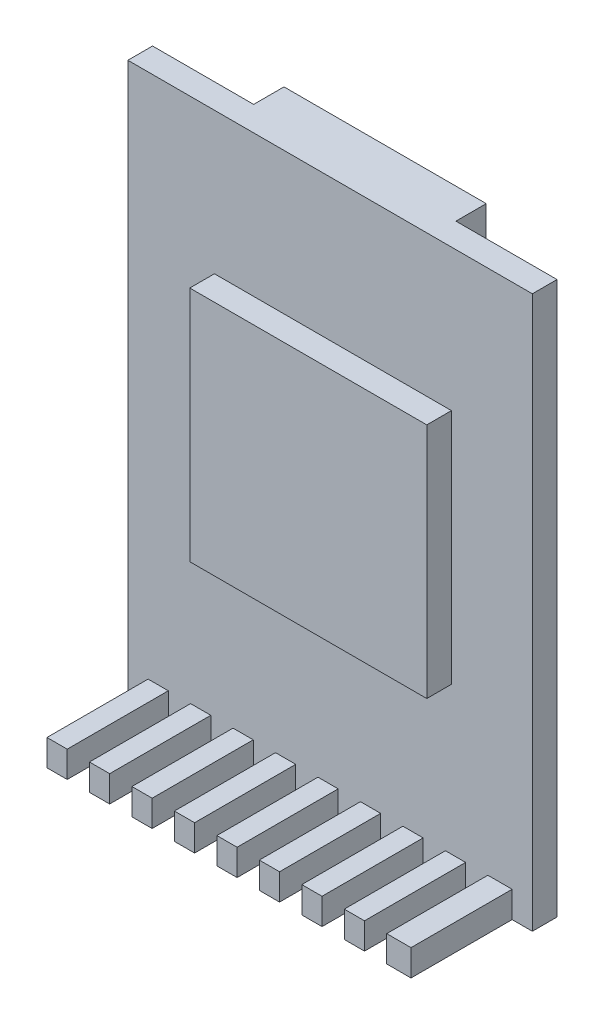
ISO-10303-21;
HEADER;
FILE_DESCRIPTION(('STEP AP214'),'2;1');
FILE_NAME('part.step','',(''),(''),'','','');
FILE_SCHEMA(('AUTOMOTIVE_DESIGN { 1 0 10303 214 1 1 1 1 }'));
ENDSEC;
DATA;
#1=APPLICATION_CONTEXT('core data for automotive mechanical design processes');
#2=APPLICATION_PROTOCOL_DEFINITION('international standard','automotive_design',2000,#1);
#3=PRODUCT_CONTEXT('',#1,'mechanical');
#4=PRODUCT('Part','Part','',(#3));
#5=PRODUCT_RELATED_PRODUCT_CATEGORY('part','',(#4));
#6=PRODUCT_DEFINITION_FORMATION('','',#4);
#7=PRODUCT_DEFINITION_CONTEXT('part definition',#1,'design');
#8=PRODUCT_DEFINITION('design','',#6,#7);
#9=PRODUCT_DEFINITION_SHAPE('','',#8);
#10=(LENGTH_UNIT() NAMED_UNIT(*) SI_UNIT(.MILLI.,.METRE.));
#11=(NAMED_UNIT(*) PLANE_ANGLE_UNIT() SI_UNIT($,.RADIAN.));
#12=(NAMED_UNIT(*) SI_UNIT($,.STERADIAN.) SOLID_ANGLE_UNIT());
#13=UNCERTAINTY_MEASURE_WITH_UNIT(LENGTH_MEASURE(1.E-05),#10,'distance_accuracy_value','');
#14=(GEOMETRIC_REPRESENTATION_CONTEXT(3) GLOBAL_UNCERTAINTY_ASSIGNED_CONTEXT((#13)) GLOBAL_UNIT_ASSIGNED_CONTEXT((#10,
#11,#12)) REPRESENTATION_CONTEXT('',''));
#15=CARTESIAN_POINT('',(0.,0.,0.));
#16=DIRECTION('',(0.,0.,1.));
#17=DIRECTION('',(1.,0.,0.));
#18=AXIS2_PLACEMENT_3D('',#15,#16,#17);
#19=CARTESIAN_POINT('',(1.27,1.651,7.8994));
#20=DIRECTION('',(0.,-1.,0.));
#21=DIRECTION('',(0.,0.,-1.));
#22=AXIS2_PLACEMENT_3D('',#19,#20,#21);
#23=PLANE('',#22);
#24=DIRECTION('',(-1.,0.,0.));
#25=VECTOR('',#24,1.);
#26=CARTESIAN_POINT('',(1.27,1.651,7.8994));
#27=LINE('',#26,#25);
#28=CARTESIAN_POINT('',(2.54,1.651,7.8994));
#29=VERTEX_POINT('',#28);
#30=CARTESIAN_POINT('',(1.27,1.651,7.8994));
#31=VERTEX_POINT('',#30);
#32=EDGE_CURVE('E595',#29,#31,#27,.T.);
#33=ORIENTED_EDGE('',*,*,#32,.F.);
#34=DIRECTION('',(0.,0.,1.));
#35=VECTOR('',#34,1.);
#36=CARTESIAN_POINT('',(2.54,1.651,7.8994));
#37=LINE('',#36,#35);
#38=CARTESIAN_POINT('',(2.54,1.651,1.5494));
#39=VERTEX_POINT('',#38);
#40=EDGE_CURVE('E384',#39,#29,#37,.T.);
#41=ORIENTED_EDGE('',*,*,#40,.F.);
#42=DIRECTION('',(-1.,0.,0.));
#43=VECTOR('',#42,1.);
#44=CARTESIAN_POINT('',(1.27,1.651,1.5494));
#45=LINE('',#44,#43);
#46=CARTESIAN_POINT('',(1.27,1.651,1.5494));
#47=VERTEX_POINT('',#46);
#48=EDGE_CURVE('E609',#39,#47,#45,.T.);
#49=ORIENTED_EDGE('',*,*,#48,.T.);
#50=DIRECTION('',(0.,0.,-1.));
#51=VECTOR('',#50,1.);
#52=CARTESIAN_POINT('',(1.27,1.651,7.8994));
#53=LINE('',#52,#51);
#54=EDGE_CURVE('E600',#31,#47,#53,.T.);
#55=ORIENTED_EDGE('',*,*,#54,.F.);
#56=EDGE_LOOP('',(#33,#41,#49,#55));
#57=FACE_BOUND('',#56,.T.);
#58=ADVANCED_FACE('F45',(#57),#23,.F.);
#59=CARTESIAN_POINT('',(5.207,1.651,1.5494));
#60=VERTEX_POINT('',#59);
#61=CARTESIAN_POINT('',(3.937,1.651,1.5494));
#62=VERTEX_POINT('',#61);
#63=EDGE_CURVE('E889',#60,#62,#45,.T.);
#64=ORIENTED_EDGE('',*,*,#63,.T.);
#65=DIRECTION('',(0.,0.,-1.));
#66=VECTOR('',#65,1.);
#67=CARTESIAN_POINT('',(3.937,1.651,7.8994));
#68=LINE('',#67,#66);
#69=CARTESIAN_POINT('',(3.937,1.651,7.8994));
#70=VERTEX_POINT('',#69);
#71=EDGE_CURVE('E387',#70,#62,#68,.T.);
#72=ORIENTED_EDGE('',*,*,#71,.F.);
#73=CARTESIAN_POINT('',(5.207,1.651,7.8994));
#74=VERTEX_POINT('',#73);
#75=EDGE_CURVE('E782',#74,#70,#27,.T.);
#76=ORIENTED_EDGE('',*,*,#75,.F.);
#77=DIRECTION('',(0.,0.,1.));
#78=VECTOR('',#77,1.);
#79=CARTESIAN_POINT('',(5.207,1.651,7.8994));
#80=LINE('',#79,#78);
#81=EDGE_CURVE('E388',#60,#74,#80,.T.);
#82=ORIENTED_EDGE('',*,*,#81,.F.);
#83=EDGE_LOOP('',(#64,#72,#76,#82));
#84=FACE_BOUND('',#83,.T.);
#85=ADVANCED_FACE('F953',(#84),#23,.F.);
#86=CARTESIAN_POINT('',(7.874,1.651,1.5494));
#87=VERTEX_POINT('',#86);
#88=CARTESIAN_POINT('',(6.604,1.651,1.5494));
#89=VERTEX_POINT('',#88);
#90=EDGE_CURVE('E892',#87,#89,#45,.T.);
#91=ORIENTED_EDGE('',*,*,#90,.T.);
#92=DIRECTION('',(0.,0.,-1.));
#93=VECTOR('',#92,1.);
#94=CARTESIAN_POINT('',(6.604,1.651,7.8994));
#95=LINE('',#94,#93);
#96=CARTESIAN_POINT('',(6.604,1.651,7.8994));
#97=VERTEX_POINT('',#96);
#98=EDGE_CURVE('E402',#97,#89,#95,.T.);
#99=ORIENTED_EDGE('',*,*,#98,.F.);
#100=CARTESIAN_POINT('',(7.874,1.651,7.8994));
#101=VERTEX_POINT('',#100);
#102=EDGE_CURVE('E866',#101,#97,#27,.T.);
#103=ORIENTED_EDGE('',*,*,#102,.F.);
#104=DIRECTION('',(0.,0.,1.));
#105=VECTOR('',#104,1.);
#106=CARTESIAN_POINT('',(7.874,1.651,7.8994));
#107=LINE('',#106,#105);
#108=EDGE_CURVE('E406',#87,#101,#107,.T.);
#109=ORIENTED_EDGE('',*,*,#108,.F.);
#110=EDGE_LOOP('',(#91,#99,#103,#109));
#111=FACE_BOUND('',#110,.T.);
#112=ADVANCED_FACE('F959',(#111),#23,.F.);
#113=CARTESIAN_POINT('',(10.541,1.651,1.5494));
#114=VERTEX_POINT('',#113);
#115=CARTESIAN_POINT('',(9.271,1.651,1.5494));
#116=VERTEX_POINT('',#115);
#117=EDGE_CURVE('E898',#114,#116,#45,.T.);
#118=ORIENTED_EDGE('',*,*,#117,.T.);
#119=DIRECTION('',(0.,0.,-1.));
#120=VECTOR('',#119,1.);
#121=CARTESIAN_POINT('',(9.271,1.651,7.8994));
#122=LINE('',#121,#120);
#123=CARTESIAN_POINT('',(9.271,1.651,7.8994));
#124=VERTEX_POINT('',#123);
#125=EDGE_CURVE('E415',#124,#116,#122,.T.);
#126=ORIENTED_EDGE('',*,*,#125,.F.);
#127=CARTESIAN_POINT('',(10.541,1.651,7.8994));
#128=VERTEX_POINT('',#127);
#129=EDGE_CURVE('E862',#128,#124,#27,.T.);
#130=ORIENTED_EDGE('',*,*,#129,.F.);
#131=DIRECTION('',(0.,0.,1.));
#132=VECTOR('',#131,1.);
#133=CARTESIAN_POINT('',(10.541,1.651,7.8994));
#134=LINE('',#133,#132);
#135=EDGE_CURVE('E419',#114,#128,#134,.T.);
#136=ORIENTED_EDGE('',*,*,#135,.F.);
#137=EDGE_LOOP('',(#118,#126,#130,#136));
#138=FACE_BOUND('',#137,.T.);
#139=ADVANCED_FACE('F981',(#138),#23,.F.);
#140=CARTESIAN_POINT('',(13.208,1.651,1.5494));
#141=VERTEX_POINT('',#140);
#142=CARTESIAN_POINT('',(11.938,1.651,1.5494));
#143=VERTEX_POINT('',#142);
#144=EDGE_CURVE('E905',#141,#143,#45,.T.);
#145=ORIENTED_EDGE('',*,*,#144,.T.);
#146=DIRECTION('',(0.,0.,-1.));
#147=VECTOR('',#146,1.);
#148=CARTESIAN_POINT('',(11.938,1.651,7.8994));
#149=LINE('',#148,#147);
#150=CARTESIAN_POINT('',(11.938,1.651,7.8994));
#151=VERTEX_POINT('',#150);
#152=EDGE_CURVE('E428',#151,#143,#149,.T.);
#153=ORIENTED_EDGE('',*,*,#152,.F.);
#154=CARTESIAN_POINT('',(13.208,1.651,7.8994));
#155=VERTEX_POINT('',#154);
#156=EDGE_CURVE('E858',#155,#151,#27,.T.);
#157=ORIENTED_EDGE('',*,*,#156,.F.);
#158=DIRECTION('',(0.,0.,1.));
#159=VECTOR('',#158,1.);
#160=CARTESIAN_POINT('',(13.208,1.651,7.8994));
#161=LINE('',#160,#159);
#162=EDGE_CURVE('E432',#141,#155,#161,.T.);
#163=ORIENTED_EDGE('',*,*,#162,.F.);
#164=EDGE_LOOP('',(#145,#153,#157,#163));
#165=FACE_BOUND('',#164,.T.);
#166=ADVANCED_FACE('F977',(#165),#23,.F.);
#167=CARTESIAN_POINT('',(15.875,1.651,1.5494));
#168=VERTEX_POINT('',#167);
#169=CARTESIAN_POINT('',(14.605,1.651,1.5494));
#170=VERTEX_POINT('',#169);
#171=EDGE_CURVE('E912',#168,#170,#45,.T.);
#172=ORIENTED_EDGE('',*,*,#171,.T.);
#173=DIRECTION('',(0.,0.,-1.));
#174=VECTOR('',#173,1.);
#175=CARTESIAN_POINT('',(14.605,1.651,7.8994));
#176=LINE('',#175,#174);
#177=CARTESIAN_POINT('',(14.605,1.651,7.8994));
#178=VERTEX_POINT('',#177);
#179=EDGE_CURVE('E441',#178,#170,#176,.T.);
#180=ORIENTED_EDGE('',*,*,#179,.F.);
#181=CARTESIAN_POINT('',(15.875,1.651,7.8994));
#182=VERTEX_POINT('',#181);
#183=EDGE_CURVE('E854',#182,#178,#27,.T.);
#184=ORIENTED_EDGE('',*,*,#183,.F.);
#185=DIRECTION('',(0.,0.,1.));
#186=VECTOR('',#185,1.);
#187=CARTESIAN_POINT('',(15.875,1.651,7.8994));
#188=LINE('',#187,#186);
#189=EDGE_CURVE('E445',#168,#182,#188,.T.);
#190=ORIENTED_EDGE('',*,*,#189,.F.);
#191=EDGE_LOOP('',(#172,#180,#184,#190));
#192=FACE_BOUND('',#191,.T.);
#193=ADVANCED_FACE('F973',(#192),#23,.F.);
#194=CARTESIAN_POINT('',(18.542,1.651,1.5494));
#195=VERTEX_POINT('',#194);
#196=CARTESIAN_POINT('',(17.272,1.651,1.5494));
#197=VERTEX_POINT('',#196);
#198=EDGE_CURVE('E919',#195,#197,#45,.T.);
#199=ORIENTED_EDGE('',*,*,#198,.T.);
#200=DIRECTION('',(0.,0.,-1.));
#201=VECTOR('',#200,1.);
#202=CARTESIAN_POINT('',(17.272,1.651,7.8994));
#203=LINE('',#202,#201);
#204=CARTESIAN_POINT('',(17.272,1.651,7.8994));
#205=VERTEX_POINT('',#204);
#206=EDGE_CURVE('E454',#205,#197,#203,.T.);
#207=ORIENTED_EDGE('',*,*,#206,.F.);
#208=CARTESIAN_POINT('',(18.542,1.651,7.8994));
#209=VERTEX_POINT('',#208);
#210=EDGE_CURVE('E851',#209,#205,#27,.T.);
#211=ORIENTED_EDGE('',*,*,#210,.F.);
#212=DIRECTION('',(0.,0.,1.));
#213=VECTOR('',#212,1.);
#214=CARTESIAN_POINT('',(18.542,1.651,7.8994));
#215=LINE('',#214,#213);
#216=EDGE_CURVE('E458',#195,#209,#215,.T.);
#217=ORIENTED_EDGE('',*,*,#216,.F.);
#218=EDGE_LOOP('',(#199,#207,#211,#217));
#219=FACE_BOUND('',#218,.T.);
#220=ADVANCED_FACE('F931',(#219),#23,.F.);
#221=CARTESIAN_POINT('',(21.209,1.651,1.5494));
#222=VERTEX_POINT('',#221);
#223=CARTESIAN_POINT('',(19.939,1.651,1.5494));
#224=VERTEX_POINT('',#223);
#225=EDGE_CURVE('E613',#222,#224,#45,.T.);
#226=ORIENTED_EDGE('',*,*,#225,.T.);
#227=DIRECTION('',(0.,0.,-1.));
#228=VECTOR('',#227,1.);
#229=CARTESIAN_POINT('',(19.939,1.651,7.8994));
#230=LINE('',#229,#228);
#231=CARTESIAN_POINT('',(19.939,1.651,7.8994));
#232=VERTEX_POINT('',#231);
#233=EDGE_CURVE('E467',#232,#224,#230,.T.);
#234=ORIENTED_EDGE('',*,*,#233,.F.);
#235=CARTESIAN_POINT('',(21.209,1.651,7.8994));
#236=VERTEX_POINT('',#235);
#237=EDGE_CURVE('E601',#236,#232,#27,.T.);
#238=ORIENTED_EDGE('',*,*,#237,.F.);
#239=DIRECTION('',(0.,0.,1.));
#240=VECTOR('',#239,1.);
#241=CARTESIAN_POINT('',(21.209,1.651,7.8994));
#242=LINE('',#241,#240);
#243=EDGE_CURVE('E471',#222,#236,#242,.T.);
#244=ORIENTED_EDGE('',*,*,#243,.F.);
#245=EDGE_LOOP('',(#226,#234,#238,#244));
#246=FACE_BOUND('',#245,.T.);
#247=ADVANCED_FACE('F847',(#246),#23,.F.);
#248=CARTESIAN_POINT('',(0.,0.,7.8994));
#249=DIRECTION('',(0.,0.,-1.));
#250=DIRECTION('',(-1.,0.,0.));
#251=AXIS2_PLACEMENT_3D('',#248,#249,#250);
#252=PLANE('',#251);
#253=DIRECTION('',(1.,0.,0.));
#254=VECTOR('',#253,1.);
#255=CARTESIAN_POINT('',(1.27,0.,7.8994));
#256=LINE('',#255,#254);
#257=CARTESIAN_POINT('',(1.27,0.,7.8994));
#258=VERTEX_POINT('',#257);
#259=CARTESIAN_POINT('',(2.54,0.,7.8994));
#260=VERTEX_POINT('',#259);
#261=EDGE_CURVE('E587',#258,#260,#256,.T.);
#262=ORIENTED_EDGE('',*,*,#261,.T.);
#263=DIRECTION('',(0.,1.,0.));
#264=VECTOR('',#263,1.);
#265=CARTESIAN_POINT('',(2.54,0.,7.8994));
#266=LINE('',#265,#264);
#267=EDGE_CURVE('E11',#260,#29,#266,.T.);
#268=ORIENTED_EDGE('',*,*,#267,.T.);
#269=ORIENTED_EDGE('',*,*,#32,.T.);
#270=DIRECTION('',(0.,-1.,0.));
#271=VECTOR('',#270,1.);
#272=CARTESIAN_POINT('',(1.27,0.,7.8994));
#273=LINE('',#272,#271);
#274=EDGE_CURVE('E581',#31,#258,#273,.T.);
#275=ORIENTED_EDGE('',*,*,#274,.T.);
#276=EDGE_LOOP('',(#262,#268,#269,#275));
#277=FACE_BOUND('',#276,.T.);
#278=ADVANCED_FACE('F876',(#277),#252,.F.);
#279=ORIENTED_EDGE('',*,*,#75,.T.);
#280=DIRECTION('',(0.,-1.,0.));
#281=VECTOR('',#280,1.);
#282=CARTESIAN_POINT('',(3.937,0.,7.8994));
#283=LINE('',#282,#281);
#284=CARTESIAN_POINT('',(3.937,0.,7.8994));
#285=VERTEX_POINT('',#284);
#286=EDGE_CURVE('E54',#70,#285,#283,.T.);
#287=ORIENTED_EDGE('',*,*,#286,.T.);
#288=CARTESIAN_POINT('',(5.207,0.,7.8994));
#289=VERTEX_POINT('',#288);
#290=EDGE_CURVE('E592',#285,#289,#256,.T.);
#291=ORIENTED_EDGE('',*,*,#290,.T.);
#292=DIRECTION('',(0.,1.,0.));
#293=VECTOR('',#292,1.);
#294=CARTESIAN_POINT('',(5.207,0.,7.8994));
#295=LINE('',#294,#293);
#296=EDGE_CURVE('E771',#289,#74,#295,.T.);
#297=ORIENTED_EDGE('',*,*,#296,.T.);
#298=EDGE_LOOP('',(#279,#287,#291,#297));
#299=FACE_BOUND('',#298,.T.);
#300=ADVANCED_FACE('F780',(#299),#252,.F.);
#301=ORIENTED_EDGE('',*,*,#102,.T.);
#302=DIRECTION('',(0.,-1.,0.));
#303=VECTOR('',#302,1.);
#304=CARTESIAN_POINT('',(6.604,0.,7.8994));
#305=LINE('',#304,#303);
#306=CARTESIAN_POINT('',(6.604,0.,7.8994));
#307=VERTEX_POINT('',#306);
#308=EDGE_CURVE('E767',#97,#307,#305,.T.);
#309=ORIENTED_EDGE('',*,*,#308,.T.);
#310=CARTESIAN_POINT('',(7.874,0.,7.8994));
#311=VERTEX_POINT('',#310);
#312=EDGE_CURVE('E788',#307,#311,#256,.T.);
#313=ORIENTED_EDGE('',*,*,#312,.T.);
#314=DIRECTION('',(0.,1.,0.));
#315=VECTOR('',#314,1.);
#316=CARTESIAN_POINT('',(7.874,0.,7.8994));
#317=LINE('',#316,#315);
#318=EDGE_CURVE('E763',#311,#101,#317,.T.);
#319=ORIENTED_EDGE('',*,*,#318,.T.);
#320=EDGE_LOOP('',(#301,#309,#313,#319));
#321=FACE_BOUND('',#320,.T.);
#322=ADVANCED_FACE('F1336',(#321),#252,.F.);
#323=ORIENTED_EDGE('',*,*,#129,.T.);
#324=DIRECTION('',(0.,-1.,0.));
#325=VECTOR('',#324,1.);
#326=CARTESIAN_POINT('',(9.271,0.,7.8994));
#327=LINE('',#326,#325);
#328=CARTESIAN_POINT('',(9.271,0.,7.8994));
#329=VERTEX_POINT('',#328);
#330=EDGE_CURVE('E759',#124,#329,#327,.T.);
#331=ORIENTED_EDGE('',*,*,#330,.T.);
#332=CARTESIAN_POINT('',(10.541,0.,7.8994));
#333=VERTEX_POINT('',#332);
#334=EDGE_CURVE('E791',#329,#333,#256,.T.);
#335=ORIENTED_EDGE('',*,*,#334,.T.);
#336=DIRECTION('',(0.,1.,0.));
#337=VECTOR('',#336,1.);
#338=CARTESIAN_POINT('',(10.541,0.,7.8994));
#339=LINE('',#338,#337);
#340=EDGE_CURVE('E755',#333,#128,#339,.T.);
#341=ORIENTED_EDGE('',*,*,#340,.T.);
#342=EDGE_LOOP('',(#323,#331,#335,#341));
#343=FACE_BOUND('',#342,.T.);
#344=ADVANCED_FACE('F1328',(#343),#252,.F.);
#345=ORIENTED_EDGE('',*,*,#156,.T.);
#346=DIRECTION('',(0.,-1.,0.));
#347=VECTOR('',#346,1.);
#348=CARTESIAN_POINT('',(11.938,0.,7.8994));
#349=LINE('',#348,#347);
#350=CARTESIAN_POINT('',(11.938,0.,7.8994));
#351=VERTEX_POINT('',#350);
#352=EDGE_CURVE('E751',#151,#351,#349,.T.);
#353=ORIENTED_EDGE('',*,*,#352,.T.);
#354=CARTESIAN_POINT('',(13.208,0.,7.8994));
#355=VERTEX_POINT('',#354);
#356=EDGE_CURVE('E796',#351,#355,#256,.T.);
#357=ORIENTED_EDGE('',*,*,#356,.T.);
#358=DIRECTION('',(0.,1.,0.));
#359=VECTOR('',#358,1.);
#360=CARTESIAN_POINT('',(13.208,0.,7.8994));
#361=LINE('',#360,#359);
#362=EDGE_CURVE('E747',#355,#155,#361,.T.);
#363=ORIENTED_EDGE('',*,*,#362,.T.);
#364=EDGE_LOOP('',(#345,#353,#357,#363));
#365=FACE_BOUND('',#364,.T.);
#366=ADVANCED_FACE('F1321',(#365),#252,.F.);
#367=ORIENTED_EDGE('',*,*,#183,.T.);
#368=DIRECTION('',(0.,-1.,0.));
#369=VECTOR('',#368,1.);
#370=CARTESIAN_POINT('',(14.605,0.,7.8994));
#371=LINE('',#370,#369);
#372=CARTESIAN_POINT('',(14.605,0.,7.8994));
#373=VERTEX_POINT('',#372);
#374=EDGE_CURVE('E743',#178,#373,#371,.T.);
#375=ORIENTED_EDGE('',*,*,#374,.T.);
#376=CARTESIAN_POINT('',(15.875,0.,7.8994));
#377=VERTEX_POINT('',#376);
#378=EDGE_CURVE('E801',#373,#377,#256,.T.);
#379=ORIENTED_EDGE('',*,*,#378,.T.);
#380=DIRECTION('',(0.,1.,0.));
#381=VECTOR('',#380,1.);
#382=CARTESIAN_POINT('',(15.875,0.,7.8994));
#383=LINE('',#382,#381);
#384=EDGE_CURVE('E739',#377,#182,#383,.T.);
#385=ORIENTED_EDGE('',*,*,#384,.T.);
#386=EDGE_LOOP('',(#367,#375,#379,#385));
#387=FACE_BOUND('',#386,.T.);
#388=ADVANCED_FACE('F1313',(#387),#252,.F.);
#389=ORIENTED_EDGE('',*,*,#210,.T.);
#390=DIRECTION('',(0.,-1.,0.));
#391=VECTOR('',#390,1.);
#392=CARTESIAN_POINT('',(17.272,0.,7.8994));
#393=LINE('',#392,#391);
#394=CARTESIAN_POINT('',(17.272,0.,7.8994));
#395=VERTEX_POINT('',#394);
#396=EDGE_CURVE('E735',#205,#395,#393,.T.);
#397=ORIENTED_EDGE('',*,*,#396,.T.);
#398=CARTESIAN_POINT('',(18.542,0.,7.8994));
#399=VERTEX_POINT('',#398);
#400=EDGE_CURVE('E806',#395,#399,#256,.T.);
#401=ORIENTED_EDGE('',*,*,#400,.T.);
#402=DIRECTION('',(0.,1.,0.));
#403=VECTOR('',#402,1.);
#404=CARTESIAN_POINT('',(18.542,0.,7.8994));
#405=LINE('',#404,#403);
#406=EDGE_CURVE('E731',#399,#209,#405,.T.);
#407=ORIENTED_EDGE('',*,*,#406,.T.);
#408=EDGE_LOOP('',(#389,#397,#401,#407));
#409=FACE_BOUND('',#408,.T.);
#410=ADVANCED_FACE('F937',(#409),#252,.F.);
#411=ORIENTED_EDGE('',*,*,#237,.T.);
#412=DIRECTION('',(0.,-1.,0.));
#413=VECTOR('',#412,1.);
#414=CARTESIAN_POINT('',(19.939,0.,7.8994));
#415=LINE('',#414,#413);
#416=CARTESIAN_POINT('',(19.939,0.,7.8994));
#417=VERTEX_POINT('',#416);
#418=EDGE_CURVE('E727',#232,#417,#415,.T.);
#419=ORIENTED_EDGE('',*,*,#418,.T.);
#420=CARTESIAN_POINT('',(21.209,0.,7.8994));
#421=VERTEX_POINT('',#420);
#422=EDGE_CURVE('E811',#417,#421,#256,.T.);
#423=ORIENTED_EDGE('',*,*,#422,.T.);
#424=DIRECTION('',(0.,1.,0.));
#425=VECTOR('',#424,1.);
#426=CARTESIAN_POINT('',(21.209,0.,7.8994));
#427=LINE('',#426,#425);
#428=EDGE_CURVE('E723',#421,#236,#427,.T.);
#429=ORIENTED_EDGE('',*,*,#428,.T.);
#430=EDGE_LOOP('',(#411,#419,#423,#429));
#431=FACE_BOUND('',#430,.T.);
#432=ADVANCED_FACE('F967',(#431),#252,.F.);
#433=CARTESIAN_POINT('',(0.,0.,1.5494));
#434=DIRECTION('',(0.,0.,-1.));
#435=DIRECTION('',(-1.,0.,0.));
#436=AXIS2_PLACEMENT_3D('',#433,#434,#435);
#437=PLANE('',#436);
#438=DIRECTION('',(0.,1.,0.));
#439=VECTOR('',#438,1.);
#440=CARTESIAN_POINT('',(20.32,25.776948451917,1.5494));
#441=LINE('',#440,#439);
#442=CARTESIAN_POINT('',(20.32,10.892548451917,1.5494));
#443=VERTEX_POINT('',#442);
#444=CARTESIAN_POINT('',(20.32,25.776948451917,1.5494));
#445=VERTEX_POINT('',#444);
#446=EDGE_CURVE('E629',#443,#445,#441,.T.);
#447=ORIENTED_EDGE('',*,*,#446,.F.);
#448=DIRECTION('',(1.,0.,0.));
#449=VECTOR('',#448,1.);
#450=CARTESIAN_POINT('',(5.4356,10.892548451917,1.5494));
#451=LINE('',#450,#449);
#452=CARTESIAN_POINT('',(5.4356,10.892548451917,1.5494));
#453=VERTEX_POINT('',#452);
#454=EDGE_CURVE('E635',#453,#443,#451,.T.);
#455=ORIENTED_EDGE('',*,*,#454,.F.);
#456=DIRECTION('',(0.,-1.,0.));
#457=VECTOR('',#456,1.);
#458=CARTESIAN_POINT('',(5.4356,25.776948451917,1.5494));
#459=LINE('',#458,#457);
#460=CARTESIAN_POINT('',(5.4356,25.776948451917,1.5494));
#461=VERTEX_POINT('',#460);
#462=EDGE_CURVE('E652',#461,#453,#459,.T.);
#463=ORIENTED_EDGE('',*,*,#462,.F.);
#464=DIRECTION('',(-1.,0.,0.));
#465=VECTOR('',#464,1.);
#466=CARTESIAN_POINT('',(5.4356,25.776948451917,1.5494));
#467=LINE('',#466,#465);
#468=EDGE_CURVE('E648',#445,#461,#467,.T.);
#469=ORIENTED_EDGE('',*,*,#468,.F.);
#470=EDGE_LOOP('',(#447,#455,#463,#469));
#471=FACE_BOUND('',#470,.T.);
#472=DIRECTION('',(0.,-1.,0.));
#473=VECTOR('',#472,1.);
#474=CARTESIAN_POINT('',(1.27,0.,1.5494));
#475=LINE('',#474,#473);
#476=CARTESIAN_POINT('',(1.27,0.,1.5494));
#477=VERTEX_POINT('',#476);
#478=EDGE_CURVE('E580',#47,#477,#475,.T.);
#479=ORIENTED_EDGE('',*,*,#478,.F.);
#480=ORIENTED_EDGE('',*,*,#48,.F.);
#481=DIRECTION('',(0.,1.,0.));
#482=VECTOR('',#481,1.);
#483=CARTESIAN_POINT('',(2.54,-4.699,1.5494));
#484=LINE('',#483,#482);
#485=CARTESIAN_POINT('',(2.54,0.,1.5494));
#486=VERTEX_POINT('',#485);
#487=EDGE_CURVE('E393',#486,#39,#484,.T.);
#488=ORIENTED_EDGE('',*,*,#487,.F.);
#489=DIRECTION('',(-1.,0.,0.));
#490=VECTOR('',#489,1.);
#491=CARTESIAN_POINT('',(0.,0.,1.5494));
#492=LINE('',#491,#490);
#493=CARTESIAN_POINT('',(3.937,0.,1.5494));
#494=VERTEX_POINT('',#493);
#495=EDGE_CURVE('E576',#494,#486,#492,.T.);
#496=ORIENTED_EDGE('',*,*,#495,.F.);
#497=DIRECTION('',(0.,1.,0.));
#498=VECTOR('',#497,1.);
#499=CARTESIAN_POINT('',(3.937,-4.699,1.5494));
#500=LINE('',#499,#498);
#501=EDGE_CURVE('E392',#494,#62,#500,.T.);
#502=ORIENTED_EDGE('',*,*,#501,.T.);
#503=ORIENTED_EDGE('',*,*,#63,.F.);
#504=DIRECTION('',(0.,1.,0.));
#505=VECTOR('',#504,1.);
#506=CARTESIAN_POINT('',(5.207,-4.699,1.5494));
#507=LINE('',#506,#505);
#508=CARTESIAN_POINT('',(5.207,0.,1.5494));
#509=VERTEX_POINT('',#508);
#510=EDGE_CURVE('E403',#509,#60,#507,.T.);
#511=ORIENTED_EDGE('',*,*,#510,.F.);
#512=DIRECTION('',(-1.,0.,0.));
#513=VECTOR('',#512,1.);
#514=CARTESIAN_POINT('',(0.,0.,1.5494));
#515=LINE('',#514,#513);
#516=CARTESIAN_POINT('',(6.604,0.,1.5494));
#517=VERTEX_POINT('',#516);
#518=EDGE_CURVE('E572',#517,#509,#515,.T.);
#519=ORIENTED_EDGE('',*,*,#518,.F.);
#520=DIRECTION('',(0.,1.,0.));
#521=VECTOR('',#520,1.);
#522=CARTESIAN_POINT('',(6.604,-4.699,1.5494));
#523=LINE('',#522,#521);
#524=EDGE_CURVE('E399',#517,#89,#523,.T.);
#525=ORIENTED_EDGE('',*,*,#524,.T.);
#526=ORIENTED_EDGE('',*,*,#90,.F.);
#527=DIRECTION('',(0.,1.,0.));
#528=VECTOR('',#527,1.);
#529=CARTESIAN_POINT('',(7.874,-4.699,1.5494));
#530=LINE('',#529,#528);
#531=CARTESIAN_POINT('',(7.874,0.,1.5494));
#532=VERTEX_POINT('',#531);
#533=EDGE_CURVE('E416',#532,#87,#530,.T.);
#534=ORIENTED_EDGE('',*,*,#533,.F.);
#535=DIRECTION('',(-1.,0.,0.));
#536=VECTOR('',#535,1.);
#537=CARTESIAN_POINT('',(0.,0.,1.5494));
#538=LINE('',#537,#536);
#539=CARTESIAN_POINT('',(9.271,0.,1.5494));
#540=VERTEX_POINT('',#539);
#541=EDGE_CURVE('E568',#540,#532,#538,.T.);
#542=ORIENTED_EDGE('',*,*,#541,.F.);
#543=DIRECTION('',(0.,1.,0.));
#544=VECTOR('',#543,1.);
#545=CARTESIAN_POINT('',(9.271,-4.699,1.5494));
#546=LINE('',#545,#544);
#547=EDGE_CURVE('E412',#540,#116,#546,.T.);
#548=ORIENTED_EDGE('',*,*,#547,.T.);
#549=ORIENTED_EDGE('',*,*,#117,.F.);
#550=DIRECTION('',(0.,1.,0.));
#551=VECTOR('',#550,1.);
#552=CARTESIAN_POINT('',(10.541,-4.699,1.5494));
#553=LINE('',#552,#551);
#554=CARTESIAN_POINT('',(10.541,0.,1.5494));
#555=VERTEX_POINT('',#554);
#556=EDGE_CURVE('E429',#555,#114,#553,.T.);
#557=ORIENTED_EDGE('',*,*,#556,.F.);
#558=DIRECTION('',(-1.,0.,0.));
#559=VECTOR('',#558,1.);
#560=CARTESIAN_POINT('',(0.,0.,1.5494));
#561=LINE('',#560,#559);
#562=CARTESIAN_POINT('',(11.938,0.,1.5494));
#563=VERTEX_POINT('',#562);
#564=EDGE_CURVE('E564',#563,#555,#561,.T.);
#565=ORIENTED_EDGE('',*,*,#564,.F.);
#566=DIRECTION('',(0.,1.,0.));
#567=VECTOR('',#566,1.);
#568=CARTESIAN_POINT('',(11.938,-4.699,1.5494));
#569=LINE('',#568,#567);
#570=EDGE_CURVE('E425',#563,#143,#569,.T.);
#571=ORIENTED_EDGE('',*,*,#570,.T.);
#572=ORIENTED_EDGE('',*,*,#144,.F.);
#573=DIRECTION('',(0.,1.,0.));
#574=VECTOR('',#573,1.);
#575=CARTESIAN_POINT('',(13.208,-4.699,1.5494));
#576=LINE('',#575,#574);
#577=CARTESIAN_POINT('',(13.208,0.,1.5494));
#578=VERTEX_POINT('',#577);
#579=EDGE_CURVE('E442',#578,#141,#576,.T.);
#580=ORIENTED_EDGE('',*,*,#579,.F.);
#581=DIRECTION('',(-1.,0.,0.));
#582=VECTOR('',#581,1.);
#583=CARTESIAN_POINT('',(0.,0.,1.5494));
#584=LINE('',#583,#582);
#585=CARTESIAN_POINT('',(14.605,0.,1.5494));
#586=VERTEX_POINT('',#585);
#587=EDGE_CURVE('E560',#586,#578,#584,.T.);
#588=ORIENTED_EDGE('',*,*,#587,.F.);
#589=DIRECTION('',(0.,1.,0.));
#590=VECTOR('',#589,1.);
#591=CARTESIAN_POINT('',(14.605,-4.699,1.5494));
#592=LINE('',#591,#590);
#593=EDGE_CURVE('E438',#586,#170,#592,.T.);
#594=ORIENTED_EDGE('',*,*,#593,.T.);
#595=ORIENTED_EDGE('',*,*,#171,.F.);
#596=DIRECTION('',(0.,1.,0.));
#597=VECTOR('',#596,1.);
#598=CARTESIAN_POINT('',(15.875,-4.699,1.5494));
#599=LINE('',#598,#597);
#600=CARTESIAN_POINT('',(15.875,0.,1.5494));
#601=VERTEX_POINT('',#600);
#602=EDGE_CURVE('E455',#601,#168,#599,.T.);
#603=ORIENTED_EDGE('',*,*,#602,.F.);
#604=DIRECTION('',(-1.,0.,0.));
#605=VECTOR('',#604,1.);
#606=CARTESIAN_POINT('',(0.,0.,1.5494));
#607=LINE('',#606,#605);
#608=CARTESIAN_POINT('',(17.272,0.,1.5494));
#609=VERTEX_POINT('',#608);
#610=EDGE_CURVE('E556',#609,#601,#607,.T.);
#611=ORIENTED_EDGE('',*,*,#610,.F.);
#612=DIRECTION('',(0.,1.,0.));
#613=VECTOR('',#612,1.);
#614=CARTESIAN_POINT('',(17.272,-4.699,1.5494));
#615=LINE('',#614,#613);
#616=EDGE_CURVE('E451',#609,#197,#615,.T.);
#617=ORIENTED_EDGE('',*,*,#616,.T.);
#618=ORIENTED_EDGE('',*,*,#198,.F.);
#619=DIRECTION('',(0.,1.,0.));
#620=VECTOR('',#619,1.);
#621=CARTESIAN_POINT('',(18.542,-4.699,1.5494));
#622=LINE('',#621,#620);
#623=CARTESIAN_POINT('',(18.542,0.,1.5494));
#624=VERTEX_POINT('',#623);
#625=EDGE_CURVE('E468',#624,#195,#622,.T.);
#626=ORIENTED_EDGE('',*,*,#625,.F.);
#627=DIRECTION('',(-1.,0.,0.));
#628=VECTOR('',#627,1.);
#629=CARTESIAN_POINT('',(0.,0.,1.5494));
#630=LINE('',#629,#628);
#631=CARTESIAN_POINT('',(19.939,0.,1.5494));
#632=VERTEX_POINT('',#631);
#633=EDGE_CURVE('E552',#632,#624,#630,.T.);
#634=ORIENTED_EDGE('',*,*,#633,.F.);
#635=DIRECTION('',(0.,1.,0.));
#636=VECTOR('',#635,1.);
#637=CARTESIAN_POINT('',(19.939,-4.699,1.5494));
#638=LINE('',#637,#636);
#639=EDGE_CURVE('E464',#632,#224,#638,.T.);
#640=ORIENTED_EDGE('',*,*,#639,.T.);
#641=ORIENTED_EDGE('',*,*,#225,.F.);
#642=DIRECTION('',(0.,1.,0.));
#643=VECTOR('',#642,1.);
#644=CARTESIAN_POINT('',(21.209,-4.699,1.5494));
#645=LINE('',#644,#643);
#646=CARTESIAN_POINT('',(21.209,0.,1.5494));
#647=VERTEX_POINT('',#646);
#648=EDGE_CURVE('E374',#647,#222,#645,.T.);
#649=ORIENTED_EDGE('',*,*,#648,.F.);
#650=DIRECTION('',(-1.,0.,0.));
#651=VECTOR('',#650,1.);
#652=CARTESIAN_POINT('',(0.,0.,1.5494));
#653=LINE('',#652,#651);
#654=CARTESIAN_POINT('',(22.606,0.,1.5494));
#655=VERTEX_POINT('',#654);
#656=EDGE_CURVE('E548',#655,#647,#653,.T.);
#657=ORIENTED_EDGE('',*,*,#656,.F.);
#658=DIRECTION('',(0.,1.,0.));
#659=VECTOR('',#658,1.);
#660=CARTESIAN_POINT('',(22.606,-4.699,1.5494));
#661=LINE('',#660,#659);
#662=CARTESIAN_POINT('',(22.606,1.651,1.5494));
#663=VERTEX_POINT('',#662);
#664=EDGE_CURVE('E378',#655,#663,#661,.T.);
#665=ORIENTED_EDGE('',*,*,#664,.T.);
#666=CARTESIAN_POINT('',(24.13,1.651,1.5494));
#667=VERTEX_POINT('',#666);
#668=EDGE_CURVE('E586',#667,#663,#45,.T.);
#669=ORIENTED_EDGE('',*,*,#668,.F.);
#670=DIRECTION('',(0.,1.,0.));
#671=VECTOR('',#670,1.);
#672=CARTESIAN_POINT('',(24.13,0.,1.5494));
#673=LINE('',#672,#671);
#674=CARTESIAN_POINT('',(24.13,0.,1.5494));
#675=VERTEX_POINT('',#674);
#676=EDGE_CURVE('E605',#675,#667,#673,.T.);
#677=ORIENTED_EDGE('',*,*,#676,.F.);
#678=DIRECTION('',(1.,0.,0.));
#679=VECTOR('',#678,1.);
#680=CARTESIAN_POINT('',(0.,0.,1.5494));
#681=LINE('',#680,#679);
#682=CARTESIAN_POINT('',(25.4,0.,1.5494));
#683=VERTEX_POINT('',#682);
#684=EDGE_CURVE('E679',#675,#683,#681,.T.);
#685=ORIENTED_EDGE('',*,*,#684,.T.);
#686=DIRECTION('',(0.,1.,0.));
#687=VECTOR('',#686,1.);
#688=CARTESIAN_POINT('',(25.4,0.,1.5494));
#689=LINE('',#688,#687);
#690=CARTESIAN_POINT('',(25.4,34.671,1.5494));
#691=VERTEX_POINT('',#690);
#692=EDGE_CURVE('E684',#683,#691,#689,.T.);
#693=ORIENTED_EDGE('',*,*,#692,.T.);
#694=DIRECTION('',(-1.,0.,0.));
#695=VECTOR('',#694,1.);
#696=CARTESIAN_POINT('',(0.,34.671,1.5494));
#697=LINE('',#696,#695);
#698=CARTESIAN_POINT('',(0.,34.671,1.5494));
#699=VERTEX_POINT('',#698);
#700=EDGE_CURVE('E687',#691,#699,#697,.T.);
#701=ORIENTED_EDGE('',*,*,#700,.T.);
#702=DIRECTION('',(0.,-1.,0.));
#703=VECTOR('',#702,1.);
#704=CARTESIAN_POINT('',(0.,0.,1.5494));
#705=LINE('',#704,#703);
#706=CARTESIAN_POINT('',(0.,0.,1.5494));
#707=VERTEX_POINT('',#706);
#708=EDGE_CURVE('E675',#699,#707,#705,.T.);
#709=ORIENTED_EDGE('',*,*,#708,.T.);
#710=EDGE_CURVE('E681',#707,#477,#681,.T.);
#711=ORIENTED_EDGE('',*,*,#710,.T.);
#712=EDGE_LOOP('',(#479,#480,#488,#496,#502,#503,#511,#519,#525,#526,#534,#542,#548,#549,#557,
#565,#571,#572,#580,#588,#594,#595,#603,#611,#617,#618,#626,#634,#640,#641,#649,#657,#665,#669,
#677,#685,#693,#701,#709,#711));
#713=FACE_BOUND('',#712,.T.);
#714=ADVANCED_FACE('F839',(#471,#713),#437,.F.);
#715=CARTESIAN_POINT('',(0.,0.,1.5494));
#716=DIRECTION('',(1.,0.,0.));
#717=DIRECTION('',(0.,1.,0.));
#718=AXIS2_PLACEMENT_3D('',#715,#716,#717);
#719=PLANE('',#718);
#720=DIRECTION('',(0.,-1.,0.));
#721=VECTOR('',#720,1.);
#722=CARTESIAN_POINT('',(0.,0.,0.));
#723=LINE('',#722,#721);
#724=CARTESIAN_POINT('',(0.,34.671,0.));
#725=VERTEX_POINT('',#724);
#726=CARTESIAN_POINT('',(0.,0.,0.));
#727=VERTEX_POINT('',#726);
#728=EDGE_CURVE('E674',#725,#727,#723,.T.);
#729=ORIENTED_EDGE('',*,*,#728,.T.);
#730=DIRECTION('',(0.,0.,-1.));
#731=VECTOR('',#730,1.);
#732=CARTESIAN_POINT('',(0.,0.,1.5494));
#733=LINE('',#732,#731);
#734=EDGE_CURVE('E715',#707,#727,#733,.T.);
#735=ORIENTED_EDGE('',*,*,#734,.F.);
#736=ORIENTED_EDGE('',*,*,#708,.F.);
#737=DIRECTION('',(0.,0.,-1.));
#738=VECTOR('',#737,1.);
#739=CARTESIAN_POINT('',(0.,34.671,1.5494));
#740=LINE('',#739,#738);
#741=EDGE_CURVE('E690',#699,#725,#740,.T.);
#742=ORIENTED_EDGE('',*,*,#741,.T.);
#743=EDGE_LOOP('',(#729,#735,#736,#742));
#744=FACE_BOUND('',#743,.T.);
#745=ADVANCED_FACE('F47',(#744),#719,.F.);
#746=CARTESIAN_POINT('',(0.,0.,1.5494));
#747=DIRECTION('',(0.,1.,0.));
#748=DIRECTION('',(0.,0.,1.));
#749=AXIS2_PLACEMENT_3D('',#746,#747,#748);
#750=PLANE('',#749);
#751=ORIENTED_EDGE('',*,*,#495,.T.);
#752=DIRECTION('',(0.,0.,1.));
#753=VECTOR('',#752,1.);
#754=CARTESIAN_POINT('',(2.54,0.,1.5494));
#755=LINE('',#754,#753);
#756=EDGE_CURVE('E544',#486,#260,#755,.T.);
#757=ORIENTED_EDGE('',*,*,#756,.T.);
#758=ORIENTED_EDGE('',*,*,#261,.F.);
#759=DIRECTION('',(0.,0.,-1.));
#760=VECTOR('',#759,1.);
#761=CARTESIAN_POINT('',(1.27,0.,7.8994));
#762=LINE('',#761,#760);
#763=EDGE_CURVE('E625',#258,#477,#762,.T.);
#764=ORIENTED_EDGE('',*,*,#763,.T.);
#765=ORIENTED_EDGE('',*,*,#710,.F.);
#766=ORIENTED_EDGE('',*,*,#734,.T.);
#767=DIRECTION('',(1.,0.,0.));
#768=VECTOR('',#767,1.);
#769=CARTESIAN_POINT('',(0.,0.,0.));
#770=LINE('',#769,#768);
#771=CARTESIAN_POINT('',(25.4,0.,0.));
#772=VERTEX_POINT('',#771);
#773=EDGE_CURVE('E694',#727,#772,#770,.T.);
#774=ORIENTED_EDGE('',*,*,#773,.T.);
#775=DIRECTION('',(0.,0.,-1.));
#776=VECTOR('',#775,1.);
#777=CARTESIAN_POINT('',(25.4,0.,1.5494));
#778=LINE('',#777,#776);
#779=EDGE_CURVE('E711',#683,#772,#778,.T.);
#780=ORIENTED_EDGE('',*,*,#779,.F.);
#781=ORIENTED_EDGE('',*,*,#684,.F.);
#782=DIRECTION('',(0.,0.,-1.));
#783=VECTOR('',#782,1.);
#784=CARTESIAN_POINT('',(24.13,0.,7.8994));
#785=LINE('',#784,#783);
#786=CARTESIAN_POINT('',(24.13,0.,7.8994));
#787=VERTEX_POINT('',#786);
#788=EDGE_CURVE('E621',#787,#675,#785,.T.);
#789=ORIENTED_EDGE('',*,*,#788,.F.);
#790=CARTESIAN_POINT('',(22.606,0.,7.8994));
#791=VERTEX_POINT('',#790);
#792=EDGE_CURVE('E585',#791,#787,#256,.T.);
#793=ORIENTED_EDGE('',*,*,#792,.F.);
#794=DIRECTION('',(0.,0.,-1.));
#795=VECTOR('',#794,1.);
#796=CARTESIAN_POINT('',(22.606,0.,1.5494));
#797=LINE('',#796,#795);
#798=EDGE_CURVE('E396',#791,#655,#797,.T.);
#799=ORIENTED_EDGE('',*,*,#798,.T.);
#800=ORIENTED_EDGE('',*,*,#656,.T.);
#801=DIRECTION('',(0.,0.,1.));
#802=VECTOR('',#801,1.);
#803=CARTESIAN_POINT('',(21.209,0.,1.5494));
#804=LINE('',#803,#802);
#805=EDGE_CURVE('E488',#647,#421,#804,.T.);
#806=ORIENTED_EDGE('',*,*,#805,.T.);
#807=ORIENTED_EDGE('',*,*,#422,.F.);
#808=DIRECTION('',(0.,0.,-1.));
#809=VECTOR('',#808,1.);
#810=CARTESIAN_POINT('',(19.939,0.,1.5494));
#811=LINE('',#810,#809);
#812=EDGE_CURVE('E492',#417,#632,#811,.T.);
#813=ORIENTED_EDGE('',*,*,#812,.T.);
#814=ORIENTED_EDGE('',*,*,#633,.T.);
#815=DIRECTION('',(0.,0.,1.));
#816=VECTOR('',#815,1.);
#817=CARTESIAN_POINT('',(18.542,0.,1.5494));
#818=LINE('',#817,#816);
#819=EDGE_CURVE('E496',#624,#399,#818,.T.);
#820=ORIENTED_EDGE('',*,*,#819,.T.);
#821=ORIENTED_EDGE('',*,*,#400,.F.);
#822=DIRECTION('',(0.,0.,-1.));
#823=VECTOR('',#822,1.);
#824=CARTESIAN_POINT('',(17.272,0.,1.5494));
#825=LINE('',#824,#823);
#826=EDGE_CURVE('E500',#395,#609,#825,.T.);
#827=ORIENTED_EDGE('',*,*,#826,.T.);
#828=ORIENTED_EDGE('',*,*,#610,.T.);
#829=DIRECTION('',(0.,0.,1.));
#830=VECTOR('',#829,1.);
#831=CARTESIAN_POINT('',(15.875,0.,1.5494));
#832=LINE('',#831,#830);
#833=EDGE_CURVE('E504',#601,#377,#832,.T.);
#834=ORIENTED_EDGE('',*,*,#833,.T.);
#835=ORIENTED_EDGE('',*,*,#378,.F.);
#836=DIRECTION('',(0.,0.,-1.));
#837=VECTOR('',#836,1.);
#838=CARTESIAN_POINT('',(14.605,0.,1.5494));
#839=LINE('',#838,#837);
#840=EDGE_CURVE('E508',#373,#586,#839,.T.);
#841=ORIENTED_EDGE('',*,*,#840,.T.);
#842=ORIENTED_EDGE('',*,*,#587,.T.);
#843=DIRECTION('',(0.,0.,1.));
#844=VECTOR('',#843,1.);
#845=CARTESIAN_POINT('',(13.208,0.,1.5494));
#846=LINE('',#845,#844);
#847=EDGE_CURVE('E512',#578,#355,#846,.T.);
#848=ORIENTED_EDGE('',*,*,#847,.T.);
#849=ORIENTED_EDGE('',*,*,#356,.F.);
#850=DIRECTION('',(0.,0.,-1.));
#851=VECTOR('',#850,1.);
#852=CARTESIAN_POINT('',(11.938,0.,1.5494));
#853=LINE('',#852,#851);
#854=EDGE_CURVE('E516',#351,#563,#853,.T.);
#855=ORIENTED_EDGE('',*,*,#854,.T.);
#856=ORIENTED_EDGE('',*,*,#564,.T.);
#857=DIRECTION('',(0.,0.,1.));
#858=VECTOR('',#857,1.);
#859=CARTESIAN_POINT('',(10.541,0.,1.5494));
#860=LINE('',#859,#858);
#861=EDGE_CURVE('E520',#555,#333,#860,.T.);
#862=ORIENTED_EDGE('',*,*,#861,.T.);
#863=ORIENTED_EDGE('',*,*,#334,.F.);
#864=DIRECTION('',(0.,0.,-1.));
#865=VECTOR('',#864,1.);
#866=CARTESIAN_POINT('',(9.271,0.,1.5494));
#867=LINE('',#866,#865);
#868=EDGE_CURVE('E524',#329,#540,#867,.T.);
#869=ORIENTED_EDGE('',*,*,#868,.T.);
#870=ORIENTED_EDGE('',*,*,#541,.T.);
#871=DIRECTION('',(0.,0.,1.));
#872=VECTOR('',#871,1.);
#873=CARTESIAN_POINT('',(7.874,0.,1.5494));
#874=LINE('',#873,#872);
#875=EDGE_CURVE('E528',#532,#311,#874,.T.);
#876=ORIENTED_EDGE('',*,*,#875,.T.);
#877=ORIENTED_EDGE('',*,*,#312,.F.);
#878=DIRECTION('',(0.,0.,-1.));
#879=VECTOR('',#878,1.);
#880=CARTESIAN_POINT('',(6.604,0.,1.5494));
#881=LINE('',#880,#879);
#882=EDGE_CURVE('E532',#307,#517,#881,.T.);
#883=ORIENTED_EDGE('',*,*,#882,.T.);
#884=ORIENTED_EDGE('',*,*,#518,.T.);
#885=DIRECTION('',(0.,0.,1.));
#886=VECTOR('',#885,1.);
#887=CARTESIAN_POINT('',(5.207,0.,1.5494));
#888=LINE('',#887,#886);
#889=EDGE_CURVE('E536',#509,#289,#888,.T.);
#890=ORIENTED_EDGE('',*,*,#889,.T.);
#891=ORIENTED_EDGE('',*,*,#290,.F.);
#892=DIRECTION('',(0.,0.,-1.));
#893=VECTOR('',#892,1.);
#894=CARTESIAN_POINT('',(3.937,0.,1.5494));
#895=LINE('',#894,#893);
#896=EDGE_CURVE('E540',#285,#494,#895,.T.);
#897=ORIENTED_EDGE('',*,*,#896,.T.);
#898=EDGE_LOOP('',(#751,#757,#758,#764,#765,#766,#774,#780,#781,#789,#793,#799,#800,#806,#807,
#813,#814,#820,#821,#827,#828,#834,#835,#841,#842,#848,#849,#855,#856,#862,#863,#869,#870,#876,
#877,#883,#884,#890,#891,#897));
#899=FACE_BOUND('',#898,.T.);
#900=ADVANCED_FACE('F786',(#899),#750,.F.);
#901=CARTESIAN_POINT('',(25.4,0.,1.5494));
#902=DIRECTION('',(-1.,0.,0.));
#903=DIRECTION('',(0.,-1.,0.));
#904=AXIS2_PLACEMENT_3D('',#901,#902,#903);
#905=PLANE('',#904);
#906=DIRECTION('',(0.,1.,0.));
#907=VECTOR('',#906,1.);
#908=CARTESIAN_POINT('',(25.4,0.,0.));
#909=LINE('',#908,#907);
#910=CARTESIAN_POINT('',(25.4,34.671,0.));
#911=VERTEX_POINT('',#910);
#912=EDGE_CURVE('E697',#772,#911,#909,.T.);
#913=ORIENTED_EDGE('',*,*,#912,.T.);
#914=DIRECTION('',(0.,0.,-1.));
#915=VECTOR('',#914,1.);
#916=CARTESIAN_POINT('',(25.4,34.671,1.5494));
#917=LINE('',#916,#915);
#918=EDGE_CURVE('E707',#691,#911,#917,.T.);
#919=ORIENTED_EDGE('',*,*,#918,.F.);
#920=ORIENTED_EDGE('',*,*,#692,.F.);
#921=ORIENTED_EDGE('',*,*,#779,.T.);
#922=EDGE_LOOP('',(#913,#919,#920,#921));
#923=FACE_BOUND('',#922,.T.);
#924=ADVANCED_FACE('F1178',(#923),#905,.F.);
#925=CARTESIAN_POINT('',(0.,34.671,1.5494));
#926=DIRECTION('',(0.,-1.,0.));
#927=DIRECTION('',(0.,0.,-1.));
#928=AXIS2_PLACEMENT_3D('',#925,#926,#927);
#929=PLANE('',#928);
#930=DIRECTION('',(-1.,0.,0.));
#931=VECTOR('',#930,1.);
#932=CARTESIAN_POINT('',(0.,34.671,0.));
#933=LINE('',#932,#931);
#934=CARTESIAN_POINT('',(19.05,34.671,0.));
#935=VERTEX_POINT('',#934);
#936=EDGE_CURVE('E680',#911,#935,#933,.T.);
#937=ORIENTED_EDGE('',*,*,#936,.T.);
#938=DIRECTION('',(0.,0.,1.));
#939=VECTOR('',#938,1.);
#940=CARTESIAN_POINT('',(19.05,34.671,-1.905));
#941=LINE('',#940,#939);
#942=CARTESIAN_POINT('',(19.05,34.671,-1.905));
#943=VERTEX_POINT('',#942);
#944=EDGE_CURVE('E380',#943,#935,#941,.T.);
#945=ORIENTED_EDGE('',*,*,#944,.F.);
#946=DIRECTION('',(1.,0.,0.));
#947=VECTOR('',#946,1.);
#948=CARTESIAN_POINT('',(19.05,34.671,-1.905));
#949=LINE('',#948,#947);
#950=CARTESIAN_POINT('',(6.34999999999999,34.671,-1.905));
#951=VERTEX_POINT('',#950);
#952=EDGE_CURVE('E359',#951,#943,#949,.T.);
#953=ORIENTED_EDGE('',*,*,#952,.F.);
#954=DIRECTION('',(0.,0.,1.));
#955=VECTOR('',#954,1.);
#956=CARTESIAN_POINT('',(6.34999999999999,34.671,-1.905));
#957=LINE('',#956,#955);
#958=CARTESIAN_POINT('',(6.34999999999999,34.671,0.));
#959=VERTEX_POINT('',#958);
#960=EDGE_CURVE('E355',#951,#959,#957,.T.);
#961=ORIENTED_EDGE('',*,*,#960,.T.);
#962=EDGE_CURVE('E700',#959,#725,#933,.T.);
#963=ORIENTED_EDGE('',*,*,#962,.T.);
#964=ORIENTED_EDGE('',*,*,#741,.F.);
#965=ORIENTED_EDGE('',*,*,#700,.F.);
#966=ORIENTED_EDGE('',*,*,#918,.T.);
#967=EDGE_LOOP('',(#937,#945,#953,#961,#963,#964,#965,#966));
#968=FACE_BOUND('',#967,.T.);
#969=ADVANCED_FACE('F1170',(#968),#929,.F.);
#970=CARTESIAN_POINT('',(0.,0.,0.));
#971=DIRECTION('',(0.,0.,-1.));
#972=DIRECTION('',(-1.,0.,0.));
#973=AXIS2_PLACEMENT_3D('',#970,#971,#972);
#974=PLANE('',#973);
#975=DIRECTION('',(0.,-1.,0.));
#976=VECTOR('',#975,1.);
#977=CARTESIAN_POINT('',(19.05,27.5116797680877,0.));
#978=LINE('',#977,#976);
#979=CARTESIAN_POINT('',(19.05,27.5116797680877,0.));
#980=VERTEX_POINT('',#979);
#981=EDGE_CURVE('E370',#935,#980,#978,.T.);
#982=ORIENTED_EDGE('',*,*,#981,.F.);
#983=ORIENTED_EDGE('',*,*,#936,.F.);
#984=ORIENTED_EDGE('',*,*,#912,.F.);
#985=ORIENTED_EDGE('',*,*,#773,.F.);
#986=ORIENTED_EDGE('',*,*,#728,.F.);
#987=ORIENTED_EDGE('',*,*,#962,.F.);
#988=DIRECTION('',(0.,1.,0.));
#989=VECTOR('',#988,1.);
#990=CARTESIAN_POINT('',(6.34999999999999,34.671,0.));
#991=LINE('',#990,#989);
#992=CARTESIAN_POINT('',(6.34999999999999,27.5116797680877,0.));
#993=VERTEX_POINT('',#992);
#994=EDGE_CURVE('E66',#993,#959,#991,.T.);
#995=ORIENTED_EDGE('',*,*,#994,.F.);
#996=CARTESIAN_POINT('',(12.7,27.5116797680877,0.));
#997=DIRECTION('',(0.,0.,-1.));
#998=DIRECTION('',(-1.,0.,0.));
#999=AXIS2_PLACEMENT_3D('',#996,#997,#998);
#1000=CIRCLE('',#999,6.35);
#1001=EDGE_CURVE('E61',#980,#993,#1000,.T.);
#1002=ORIENTED_EDGE('',*,*,#1001,.F.);
#1003=EDGE_LOOP('',(#982,#983,#984,#985,#986,#987,#995,#1002));
#1004=FACE_BOUND('',#1003,.T.);
#1005=ADVANCED_FACE('F1165',(#1004),#974,.T.);
#1006=CARTESIAN_POINT('',(20.32,25.776948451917,3.0988));
#1007=DIRECTION('',(-1.,0.,0.));
#1008=DIRECTION('',(0.,-1.,0.));
#1009=AXIS2_PLACEMENT_3D('',#1006,#1007,#1008);
#1010=PLANE('',#1009);
#1011=ORIENTED_EDGE('',*,*,#446,.T.);
#1012=DIRECTION('',(0.,0.,-1.));
#1013=VECTOR('',#1012,1.);
#1014=CARTESIAN_POINT('',(20.32,25.776948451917,3.0988));
#1015=LINE('',#1014,#1013);
#1016=CARTESIAN_POINT('',(20.32,25.776948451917,3.0988));
#1017=VERTEX_POINT('',#1016);
#1018=EDGE_CURVE('E670',#1017,#445,#1015,.T.);
#1019=ORIENTED_EDGE('',*,*,#1018,.F.);
#1020=DIRECTION('',(0.,1.,0.));
#1021=VECTOR('',#1020,1.);
#1022=CARTESIAN_POINT('',(20.32,25.776948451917,3.0988));
#1023=LINE('',#1022,#1021);
#1024=CARTESIAN_POINT('',(20.32,10.892548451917,3.0988));
#1025=VERTEX_POINT('',#1024);
#1026=EDGE_CURVE('E630',#1025,#1017,#1023,.T.);
#1027=ORIENTED_EDGE('',*,*,#1026,.F.);
#1028=DIRECTION('',(0.,0.,-1.));
#1029=VECTOR('',#1028,1.);
#1030=CARTESIAN_POINT('',(20.32,10.892548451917,3.0988));
#1031=LINE('',#1030,#1029);
#1032=EDGE_CURVE('E644',#1025,#443,#1031,.T.);
#1033=ORIENTED_EDGE('',*,*,#1032,.T.);
#1034=EDGE_LOOP('',(#1011,#1019,#1027,#1033));
#1035=FACE_BOUND('',#1034,.T.);
#1036=ADVANCED_FACE('F1169',(#1035),#1010,.F.);
#1037=CARTESIAN_POINT('',(5.4356,25.776948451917,3.0988));
#1038=DIRECTION('',(0.,-1.,0.));
#1039=DIRECTION('',(1.,0.,0.));
#1040=AXIS2_PLACEMENT_3D('',#1037,#1038,#1039);
#1041=PLANE('',#1040);
#1042=ORIENTED_EDGE('',*,*,#468,.T.);
#1043=DIRECTION('',(0.,0.,-1.));
#1044=VECTOR('',#1043,1.);
#1045=CARTESIAN_POINT('',(5.4356,25.776948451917,3.0988));
#1046=LINE('',#1045,#1044);
#1047=CARTESIAN_POINT('',(5.4356,25.776948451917,3.0988));
#1048=VERTEX_POINT('',#1047);
#1049=EDGE_CURVE('E666',#1048,#461,#1046,.T.);
#1050=ORIENTED_EDGE('',*,*,#1049,.F.);
#1051=DIRECTION('',(-1.,0.,0.));
#1052=VECTOR('',#1051,1.);
#1053=CARTESIAN_POINT('',(5.4356,25.776948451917,3.0988));
#1054=LINE('',#1053,#1052);
#1055=EDGE_CURVE('E634',#1017,#1048,#1054,.T.);
#1056=ORIENTED_EDGE('',*,*,#1055,.F.);
#1057=ORIENTED_EDGE('',*,*,#1018,.T.);
#1058=EDGE_LOOP('',(#1042,#1050,#1056,#1057));
#1059=FACE_BOUND('',#1058,.T.);
#1060=ADVANCED_FACE('F1262',(#1059),#1041,.F.);
#1061=CARTESIAN_POINT('',(5.4356,25.776948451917,3.0988));
#1062=DIRECTION('',(1.,0.,0.));
#1063=DIRECTION('',(0.,1.,0.));
#1064=AXIS2_PLACEMENT_3D('',#1061,#1062,#1063);
#1065=PLANE('',#1064);
#1066=ORIENTED_EDGE('',*,*,#462,.T.);
#1067=DIRECTION('',(0.,0.,-1.));
#1068=VECTOR('',#1067,1.);
#1069=CARTESIAN_POINT('',(5.4356,10.892548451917,3.0988));
#1070=LINE('',#1069,#1068);
#1071=CARTESIAN_POINT('',(5.4356,10.892548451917,3.0988));
#1072=VERTEX_POINT('',#1071);
#1073=EDGE_CURVE('E662',#1072,#453,#1070,.T.);
#1074=ORIENTED_EDGE('',*,*,#1073,.F.);
#1075=DIRECTION('',(0.,-1.,0.));
#1076=VECTOR('',#1075,1.);
#1077=CARTESIAN_POINT('',(5.4356,25.776948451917,3.0988));
#1078=LINE('',#1077,#1076);
#1079=EDGE_CURVE('E638',#1048,#1072,#1078,.T.);
#1080=ORIENTED_EDGE('',*,*,#1079,.F.);
#1081=ORIENTED_EDGE('',*,*,#1049,.T.);
#1082=EDGE_LOOP('',(#1066,#1074,#1080,#1081));
#1083=FACE_BOUND('',#1082,.T.);
#1084=ADVANCED_FACE('F1266',(#1083),#1065,.F.);
#1085=CARTESIAN_POINT('',(5.4356,10.892548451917,3.0988));
#1086=DIRECTION('',(0.,1.,0.));
#1087=DIRECTION('',(0.,0.,1.));
#1088=AXIS2_PLACEMENT_3D('',#1085,#1086,#1087);
#1089=PLANE('',#1088);
#1090=ORIENTED_EDGE('',*,*,#454,.T.);
#1091=ORIENTED_EDGE('',*,*,#1032,.F.);
#1092=DIRECTION('',(1.,0.,0.));
#1093=VECTOR('',#1092,1.);
#1094=CARTESIAN_POINT('',(5.4356,10.892548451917,3.0988));
#1095=LINE('',#1094,#1093);
#1096=EDGE_CURVE('E641',#1072,#1025,#1095,.T.);
#1097=ORIENTED_EDGE('',*,*,#1096,.F.);
#1098=ORIENTED_EDGE('',*,*,#1073,.T.);
#1099=EDGE_LOOP('',(#1090,#1091,#1097,#1098));
#1100=FACE_BOUND('',#1099,.T.);
#1101=ADVANCED_FACE('F1270',(#1100),#1089,.F.);
#1102=CARTESIAN_POINT('',(0.,0.,3.0988));
#1103=DIRECTION('',(0.,0.,1.));
#1104=DIRECTION('',(1.,0.,0.));
#1105=AXIS2_PLACEMENT_3D('',#1102,#1103,#1104);
#1106=PLANE('',#1105);
#1107=ORIENTED_EDGE('',*,*,#1026,.T.);
#1108=ORIENTED_EDGE('',*,*,#1055,.T.);
#1109=ORIENTED_EDGE('',*,*,#1079,.T.);
#1110=ORIENTED_EDGE('',*,*,#1096,.T.);
#1111=EDGE_LOOP('',(#1107,#1108,#1109,#1110));
#1112=FACE_BOUND('',#1111,.T.);
#1113=ADVANCED_FACE('F1274',(#1112),#1106,.T.);
#1114=CARTESIAN_POINT('',(1.27,0.,7.8994));
#1115=DIRECTION('',(1.,0.,0.));
#1116=DIRECTION('',(0.,0.,-1.));
#1117=AXIS2_PLACEMENT_3D('',#1114,#1115,#1116);
#1118=PLANE('',#1117);
#1119=ORIENTED_EDGE('',*,*,#478,.T.);
#1120=ORIENTED_EDGE('',*,*,#763,.F.);
#1121=ORIENTED_EDGE('',*,*,#274,.F.);
#1122=ORIENTED_EDGE('',*,*,#54,.T.);
#1123=EDGE_LOOP('',(#1119,#1120,#1121,#1122));
#1124=FACE_BOUND('',#1123,.T.);
#1125=ADVANCED_FACE('F883',(#1124),#1118,.F.);
#1126=CARTESIAN_POINT('',(24.13,0.,7.8994));
#1127=DIRECTION('',(-1.,0.,0.));
#1128=DIRECTION('',(0.,0.,1.));
#1129=AXIS2_PLACEMENT_3D('',#1126,#1127,#1128);
#1130=PLANE('',#1129);
#1131=ORIENTED_EDGE('',*,*,#676,.T.);
#1132=DIRECTION('',(0.,0.,-1.));
#1133=VECTOR('',#1132,1.);
#1134=CARTESIAN_POINT('',(24.13,1.651,7.8994));
#1135=LINE('',#1134,#1133);
#1136=CARTESIAN_POINT('',(24.13,1.651,7.8994));
#1137=VERTEX_POINT('',#1136);
#1138=EDGE_CURVE('E617',#1137,#667,#1135,.T.);
#1139=ORIENTED_EDGE('',*,*,#1138,.F.);
#1140=DIRECTION('',(0.,1.,0.));
#1141=VECTOR('',#1140,1.);
#1142=CARTESIAN_POINT('',(24.13,0.,7.8994));
#1143=LINE('',#1142,#1141);
#1144=EDGE_CURVE('E591',#787,#1137,#1143,.T.);
#1145=ORIENTED_EDGE('',*,*,#1144,.F.);
#1146=ORIENTED_EDGE('',*,*,#788,.T.);
#1147=EDGE_LOOP('',(#1131,#1139,#1145,#1146));
#1148=FACE_BOUND('',#1147,.T.);
#1149=ADVANCED_FACE('F828',(#1148),#1130,.F.);
#1150=ORIENTED_EDGE('',*,*,#668,.T.);
#1151=DIRECTION('',(0.,0.,-1.));
#1152=VECTOR('',#1151,1.);
#1153=CARTESIAN_POINT('',(22.606,1.651,7.8994));
#1154=LINE('',#1153,#1152);
#1155=CARTESIAN_POINT('',(22.606,1.651,7.8994));
#1156=VERTEX_POINT('',#1155);
#1157=EDGE_CURVE('E478',#1156,#663,#1154,.T.);
#1158=ORIENTED_EDGE('',*,*,#1157,.F.);
#1159=EDGE_CURVE('E596',#1137,#1156,#27,.T.);
#1160=ORIENTED_EDGE('',*,*,#1159,.F.);
#1161=ORIENTED_EDGE('',*,*,#1138,.T.);
#1162=EDGE_LOOP('',(#1150,#1158,#1160,#1161));
#1163=FACE_BOUND('',#1162,.T.);
#1164=ADVANCED_FACE('F832',(#1163),#23,.F.);
#1165=ORIENTED_EDGE('',*,*,#1159,.T.);
#1166=DIRECTION('',(0.,-1.,0.));
#1167=VECTOR('',#1166,1.);
#1168=CARTESIAN_POINT('',(22.606,0.,7.8994));
#1169=LINE('',#1168,#1167);
#1170=EDGE_CURVE('E719',#1156,#791,#1169,.T.);
#1171=ORIENTED_EDGE('',*,*,#1170,.T.);
#1172=ORIENTED_EDGE('',*,*,#792,.T.);
#1173=ORIENTED_EDGE('',*,*,#1144,.T.);
#1174=EDGE_LOOP('',(#1165,#1171,#1172,#1173));
#1175=FACE_BOUND('',#1174,.T.);
#1176=ADVANCED_FACE('F822',(#1175),#252,.F.);
#1177=CARTESIAN_POINT('',(21.209,-4.699,7.8994));
#1178=DIRECTION('',(-1.,0.,0.));
#1179=DIRECTION('',(0.,0.,1.));
#1180=AXIS2_PLACEMENT_3D('',#1177,#1178,#1179);
#1181=PLANE('',#1180);
#1182=ORIENTED_EDGE('',*,*,#648,.T.);
#1183=ORIENTED_EDGE('',*,*,#243,.T.);
#1184=ORIENTED_EDGE('',*,*,#428,.F.);
#1185=ORIENTED_EDGE('',*,*,#805,.F.);
#1186=EDGE_LOOP('',(#1182,#1183,#1184,#1185));
#1187=FACE_BOUND('',#1186,.T.);
#1188=ADVANCED_FACE('F844',(#1187),#1181,.F.);
#1189=CARTESIAN_POINT('',(22.606,-4.699,7.8994));
#1190=DIRECTION('',(1.,0.,0.));
#1191=DIRECTION('',(0.,0.,-1.));
#1192=AXIS2_PLACEMENT_3D('',#1189,#1190,#1191);
#1193=PLANE('',#1192);
#1194=ORIENTED_EDGE('',*,*,#1170,.F.);
#1195=ORIENTED_EDGE('',*,*,#1157,.T.);
#1196=ORIENTED_EDGE('',*,*,#664,.F.);
#1197=ORIENTED_EDGE('',*,*,#798,.F.);
#1198=EDGE_LOOP('',(#1194,#1195,#1196,#1197));
#1199=FACE_BOUND('',#1198,.T.);
#1200=ADVANCED_FACE('F835',(#1199),#1193,.F.);
#1201=CARTESIAN_POINT('',(18.542,-4.699,7.8994));
#1202=DIRECTION('',(-1.,0.,0.));
#1203=DIRECTION('',(0.,0.,1.));
#1204=AXIS2_PLACEMENT_3D('',#1201,#1202,#1203);
#1205=PLANE('',#1204);
#1206=ORIENTED_EDGE('',*,*,#625,.T.);
#1207=ORIENTED_EDGE('',*,*,#216,.T.);
#1208=ORIENTED_EDGE('',*,*,#406,.F.);
#1209=ORIENTED_EDGE('',*,*,#819,.F.);
#1210=EDGE_LOOP('',(#1206,#1207,#1208,#1209));
#1211=FACE_BOUND('',#1210,.T.);
#1212=ADVANCED_FACE('F939',(#1211),#1205,.F.);
#1213=CARTESIAN_POINT('',(19.939,-4.699,7.8994));
#1214=DIRECTION('',(1.,0.,0.));
#1215=DIRECTION('',(0.,0.,-1.));
#1216=AXIS2_PLACEMENT_3D('',#1213,#1214,#1215);
#1217=PLANE('',#1216);
#1218=ORIENTED_EDGE('',*,*,#418,.F.);
#1219=ORIENTED_EDGE('',*,*,#233,.T.);
#1220=ORIENTED_EDGE('',*,*,#639,.F.);
#1221=ORIENTED_EDGE('',*,*,#812,.F.);
#1222=EDGE_LOOP('',(#1218,#1219,#1220,#1221));
#1223=FACE_BOUND('',#1222,.T.);
#1224=ADVANCED_FACE('F941',(#1223),#1217,.F.);
#1225=CARTESIAN_POINT('',(15.875,-4.699,7.8994));
#1226=DIRECTION('',(-1.,0.,0.));
#1227=DIRECTION('',(0.,0.,1.));
#1228=AXIS2_PLACEMENT_3D('',#1225,#1226,#1227);
#1229=PLANE('',#1228);
#1230=ORIENTED_EDGE('',*,*,#602,.T.);
#1231=ORIENTED_EDGE('',*,*,#189,.T.);
#1232=ORIENTED_EDGE('',*,*,#384,.F.);
#1233=ORIENTED_EDGE('',*,*,#833,.F.);
#1234=EDGE_LOOP('',(#1230,#1231,#1232,#1233));
#1235=FACE_BOUND('',#1234,.T.);
#1236=ADVANCED_FACE('F947',(#1235),#1229,.F.);
#1237=CARTESIAN_POINT('',(17.272,-4.699,7.8994));
#1238=DIRECTION('',(1.,0.,0.));
#1239=DIRECTION('',(0.,0.,-1.));
#1240=AXIS2_PLACEMENT_3D('',#1237,#1238,#1239);
#1241=PLANE('',#1240);
#1242=ORIENTED_EDGE('',*,*,#396,.F.);
#1243=ORIENTED_EDGE('',*,*,#206,.T.);
#1244=ORIENTED_EDGE('',*,*,#616,.F.);
#1245=ORIENTED_EDGE('',*,*,#826,.F.);
#1246=EDGE_LOOP('',(#1242,#1243,#1244,#1245));
#1247=FACE_BOUND('',#1246,.T.);
#1248=ADVANCED_FACE('F936',(#1247),#1241,.F.);
#1249=CARTESIAN_POINT('',(13.208,-4.699,7.8994));
#1250=DIRECTION('',(-1.,0.,0.));
#1251=DIRECTION('',(0.,0.,1.));
#1252=AXIS2_PLACEMENT_3D('',#1249,#1250,#1251);
#1253=PLANE('',#1252);
#1254=ORIENTED_EDGE('',*,*,#579,.T.);
#1255=ORIENTED_EDGE('',*,*,#162,.T.);
#1256=ORIENTED_EDGE('',*,*,#362,.F.);
#1257=ORIENTED_EDGE('',*,*,#847,.F.);
#1258=EDGE_LOOP('',(#1254,#1255,#1256,#1257));
#1259=FACE_BOUND('',#1258,.T.);
#1260=ADVANCED_FACE('F1041',(#1259),#1253,.F.);
#1261=CARTESIAN_POINT('',(14.605,-4.699,7.8994));
#1262=DIRECTION('',(1.,0.,0.));
#1263=DIRECTION('',(0.,0.,-1.));
#1264=AXIS2_PLACEMENT_3D('',#1261,#1262,#1263);
#1265=PLANE('',#1264);
#1266=ORIENTED_EDGE('',*,*,#374,.F.);
#1267=ORIENTED_EDGE('',*,*,#179,.T.);
#1268=ORIENTED_EDGE('',*,*,#593,.F.);
#1269=ORIENTED_EDGE('',*,*,#840,.F.);
#1270=EDGE_LOOP('',(#1266,#1267,#1268,#1269));
#1271=FACE_BOUND('',#1270,.T.);
#1272=ADVANCED_FACE('F1048',(#1271),#1265,.F.);
#1273=CARTESIAN_POINT('',(10.541,-4.699,7.8994));
#1274=DIRECTION('',(-1.,0.,0.));
#1275=DIRECTION('',(0.,0.,1.));
#1276=AXIS2_PLACEMENT_3D('',#1273,#1274,#1275);
#1277=PLANE('',#1276);
#1278=ORIENTED_EDGE('',*,*,#556,.T.);
#1279=ORIENTED_EDGE('',*,*,#135,.T.);
#1280=ORIENTED_EDGE('',*,*,#340,.F.);
#1281=ORIENTED_EDGE('',*,*,#861,.F.);
#1282=EDGE_LOOP('',(#1278,#1279,#1280,#1281));
#1283=FACE_BOUND('',#1282,.T.);
#1284=ADVANCED_FACE('F1057',(#1283),#1277,.F.);
#1285=CARTESIAN_POINT('',(11.938,-4.699,7.8994));
#1286=DIRECTION('',(1.,0.,0.));
#1287=DIRECTION('',(0.,0.,-1.));
#1288=AXIS2_PLACEMENT_3D('',#1285,#1286,#1287);
#1289=PLANE('',#1288);
#1290=ORIENTED_EDGE('',*,*,#352,.F.);
#1291=ORIENTED_EDGE('',*,*,#152,.T.);
#1292=ORIENTED_EDGE('',*,*,#570,.F.);
#1293=ORIENTED_EDGE('',*,*,#854,.F.);
#1294=EDGE_LOOP('',(#1290,#1291,#1292,#1293));
#1295=FACE_BOUND('',#1294,.T.);
#1296=ADVANCED_FACE('F1066',(#1295),#1289,.F.);
#1297=CARTESIAN_POINT('',(7.874,-4.699,7.8994));
#1298=DIRECTION('',(-1.,0.,0.));
#1299=DIRECTION('',(0.,0.,1.));
#1300=AXIS2_PLACEMENT_3D('',#1297,#1298,#1299);
#1301=PLANE('',#1300);
#1302=ORIENTED_EDGE('',*,*,#533,.T.);
#1303=ORIENTED_EDGE('',*,*,#108,.T.);
#1304=ORIENTED_EDGE('',*,*,#318,.F.);
#1305=ORIENTED_EDGE('',*,*,#875,.F.);
#1306=EDGE_LOOP('',(#1302,#1303,#1304,#1305));
#1307=FACE_BOUND('',#1306,.T.);
#1308=ADVANCED_FACE('F1075',(#1307),#1301,.F.);
#1309=CARTESIAN_POINT('',(9.271,-4.699,7.8994));
#1310=DIRECTION('',(1.,0.,0.));
#1311=DIRECTION('',(0.,0.,-1.));
#1312=AXIS2_PLACEMENT_3D('',#1309,#1310,#1311);
#1313=PLANE('',#1312);
#1314=ORIENTED_EDGE('',*,*,#330,.F.);
#1315=ORIENTED_EDGE('',*,*,#125,.T.);
#1316=ORIENTED_EDGE('',*,*,#547,.F.);
#1317=ORIENTED_EDGE('',*,*,#868,.F.);
#1318=EDGE_LOOP('',(#1314,#1315,#1316,#1317));
#1319=FACE_BOUND('',#1318,.T.);
#1320=ADVANCED_FACE('F1084',(#1319),#1313,.F.);
#1321=CARTESIAN_POINT('',(5.207,-4.699,7.8994));
#1322=DIRECTION('',(-1.,0.,0.));
#1323=DIRECTION('',(0.,0.,1.));
#1324=AXIS2_PLACEMENT_3D('',#1321,#1322,#1323);
#1325=PLANE('',#1324);
#1326=ORIENTED_EDGE('',*,*,#510,.T.);
#1327=ORIENTED_EDGE('',*,*,#81,.T.);
#1328=ORIENTED_EDGE('',*,*,#296,.F.);
#1329=ORIENTED_EDGE('',*,*,#889,.F.);
#1330=EDGE_LOOP('',(#1326,#1327,#1328,#1329));
#1331=FACE_BOUND('',#1330,.T.);
#1332=ADVANCED_FACE('F1093',(#1331),#1325,.F.);
#1333=CARTESIAN_POINT('',(6.604,-4.699,7.8994));
#1334=DIRECTION('',(1.,0.,0.));
#1335=DIRECTION('',(0.,0.,-1.));
#1336=AXIS2_PLACEMENT_3D('',#1333,#1334,#1335);
#1337=PLANE('',#1336);
#1338=ORIENTED_EDGE('',*,*,#308,.F.);
#1339=ORIENTED_EDGE('',*,*,#98,.T.);
#1340=ORIENTED_EDGE('',*,*,#524,.F.);
#1341=ORIENTED_EDGE('',*,*,#882,.F.);
#1342=EDGE_LOOP('',(#1338,#1339,#1340,#1341));
#1343=FACE_BOUND('',#1342,.T.);
#1344=ADVANCED_FACE('F1102',(#1343),#1337,.F.);
#1345=CARTESIAN_POINT('',(2.54,-4.699,7.8994));
#1346=DIRECTION('',(-1.,0.,0.));
#1347=DIRECTION('',(0.,0.,1.));
#1348=AXIS2_PLACEMENT_3D('',#1345,#1346,#1347);
#1349=PLANE('',#1348);
#1350=ORIENTED_EDGE('',*,*,#487,.T.);
#1351=ORIENTED_EDGE('',*,*,#40,.T.);
#1352=ORIENTED_EDGE('',*,*,#267,.F.);
#1353=ORIENTED_EDGE('',*,*,#756,.F.);
#1354=EDGE_LOOP('',(#1350,#1351,#1352,#1353));
#1355=FACE_BOUND('',#1354,.T.);
#1356=ADVANCED_FACE('F886',(#1355),#1349,.F.);
#1357=CARTESIAN_POINT('',(3.937,-4.699,7.8994));
#1358=DIRECTION('',(1.,0.,0.));
#1359=DIRECTION('',(0.,0.,-1.));
#1360=AXIS2_PLACEMENT_3D('',#1357,#1358,#1359);
#1361=PLANE('',#1360);
#1362=ORIENTED_EDGE('',*,*,#286,.F.);
#1363=ORIENTED_EDGE('',*,*,#71,.T.);
#1364=ORIENTED_EDGE('',*,*,#501,.F.);
#1365=ORIENTED_EDGE('',*,*,#896,.F.);
#1366=EDGE_LOOP('',(#1362,#1363,#1364,#1365));
#1367=FACE_BOUND('',#1366,.T.);
#1368=ADVANCED_FACE('F1119',(#1367),#1361,.F.);
#1369=CARTESIAN_POINT('',(12.7,27.5116797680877,-1.905));
#1370=DIRECTION('',(0.,0.,1.));
#1371=DIRECTION('',(1.,0.,0.));
#1372=AXIS2_PLACEMENT_3D('',#1369,#1370,#1371);
#1373=CYLINDRICAL_SURFACE('',#1372,6.35);
#1374=ORIENTED_EDGE('',*,*,#1001,.T.);
#1375=DIRECTION('',(0.,0.,1.));
#1376=VECTOR('',#1375,1.);
#1377=CARTESIAN_POINT('',(6.34999999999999,27.5116797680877,-1.905));
#1378=LINE('',#1377,#1376);
#1379=CARTESIAN_POINT('',(6.34999999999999,27.5116797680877,-1.905));
#1380=VERTEX_POINT('',#1379);
#1381=EDGE_CURVE('E353',#1380,#993,#1378,.T.);
#1382=ORIENTED_EDGE('',*,*,#1381,.F.);
#1383=CARTESIAN_POINT('',(12.7,27.5116797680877,-1.905));
#1384=DIRECTION('',(0.,0.,-1.));
#1385=DIRECTION('',(-1.,0.,0.));
#1386=AXIS2_PLACEMENT_3D('',#1383,#1384,#1385);
#1387=CIRCLE('',#1386,6.35);
#1388=CARTESIAN_POINT('',(19.05,27.5116797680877,-1.905));
#1389=VERTEX_POINT('',#1388);
#1390=EDGE_CURVE('E360',#1389,#1380,#1387,.T.);
#1391=ORIENTED_EDGE('',*,*,#1390,.F.);
#1392=DIRECTION('',(0.,0.,1.));
#1393=VECTOR('',#1392,1.);
#1394=CARTESIAN_POINT('',(19.05,27.5116797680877,-1.905));
#1395=LINE('',#1394,#1393);
#1396=EDGE_CURVE('E1247',#1389,#980,#1395,.T.);
#1397=ORIENTED_EDGE('',*,*,#1396,.T.);
#1398=EDGE_LOOP('',(#1374,#1382,#1391,#1397));
#1399=FACE_BOUND('',#1398,.T.);
#1400=ADVANCED_FACE('F372',(#1399),#1373,.T.);
#1401=CARTESIAN_POINT('',(6.34999999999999,34.671,-1.905));
#1402=DIRECTION('',(1.,0.,0.));
#1403=DIRECTION('',(0.,1.,0.));
#1404=AXIS2_PLACEMENT_3D('',#1401,#1402,#1403);
#1405=PLANE('',#1404);
#1406=ORIENTED_EDGE('',*,*,#994,.T.);
#1407=ORIENTED_EDGE('',*,*,#960,.F.);
#1408=DIRECTION('',(0.,1.,0.));
#1409=VECTOR('',#1408,1.);
#1410=CARTESIAN_POINT('',(6.34999999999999,34.671,-1.905));
#1411=LINE('',#1410,#1409);
#1412=EDGE_CURVE('E349',#1380,#951,#1411,.T.);
#1413=ORIENTED_EDGE('',*,*,#1412,.F.);
#1414=ORIENTED_EDGE('',*,*,#1381,.T.);
#1415=EDGE_LOOP('',(#1406,#1407,#1413,#1414));
#1416=FACE_BOUND('',#1415,.T.);
#1417=ADVANCED_FACE('F351',(#1416),#1405,.F.);
#1418=CARTESIAN_POINT('',(19.05,27.5116797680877,-1.905));
#1419=DIRECTION('',(-1.,0.,0.));
#1420=DIRECTION('',(0.,0.,1.));
#1421=AXIS2_PLACEMENT_3D('',#1418,#1419,#1420);
#1422=PLANE('',#1421);
#1423=ORIENTED_EDGE('',*,*,#981,.T.);
#1424=ORIENTED_EDGE('',*,*,#1396,.F.);
#1425=DIRECTION('',(0.,-1.,0.));
#1426=VECTOR('',#1425,1.);
#1427=CARTESIAN_POINT('',(19.05,27.5116797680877,-1.905));
#1428=LINE('',#1427,#1426);
#1429=EDGE_CURVE('E365',#943,#1389,#1428,.T.);
#1430=ORIENTED_EDGE('',*,*,#1429,.F.);
#1431=ORIENTED_EDGE('',*,*,#944,.T.);
#1432=EDGE_LOOP('',(#1423,#1424,#1430,#1431));
#1433=FACE_BOUND('',#1432,.T.);
#1434=ADVANCED_FACE('F1142',(#1433),#1422,.F.);
#1435=CARTESIAN_POINT('',(12.7,27.5116797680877,-1.905));
#1436=DIRECTION('',(0.,0.,-1.));
#1437=DIRECTION('',(-1.,0.,0.));
#1438=AXIS2_PLACEMENT_3D('',#1435,#1436,#1437);
#1439=PLANE('',#1438);
#1440=ORIENTED_EDGE('',*,*,#1390,.T.);
#1441=ORIENTED_EDGE('',*,*,#1412,.T.);
#1442=ORIENTED_EDGE('',*,*,#952,.T.);
#1443=ORIENTED_EDGE('',*,*,#1429,.T.);
#1444=EDGE_LOOP('',(#1440,#1441,#1442,#1443));
#1445=FACE_BOUND('',#1444,.T.);
#1446=ADVANCED_FACE('F363',(#1445),#1439,.T.);
#1447=CLOSED_SHELL('',(#58,#85,#112,#139,#166,#193,#220,#247,#278,#300,#322,#344,#366,#388,#410,
#432,#714,#745,#900,#924,#969,#1005,#1036,#1060,#1084,#1101,#1113,#1125,#1149,#1164,#1176,#1188,
#1200,#1212,#1224,#1236,#1248,#1260,#1272,#1284,#1296,#1308,#1320,#1332,#1344,#1356,#1368,#1400,
#1417,#1434,#1446));
#1448=MANIFOLD_SOLID_BREP('B2',#1447);
#1449=ADVANCED_BREP_SHAPE_REPRESENTATION('',(#18,#1448),#14);
#1450=SHAPE_DEFINITION_REPRESENTATION(#9,#1449);
ENDSEC;
END-ISO-10303-21;
